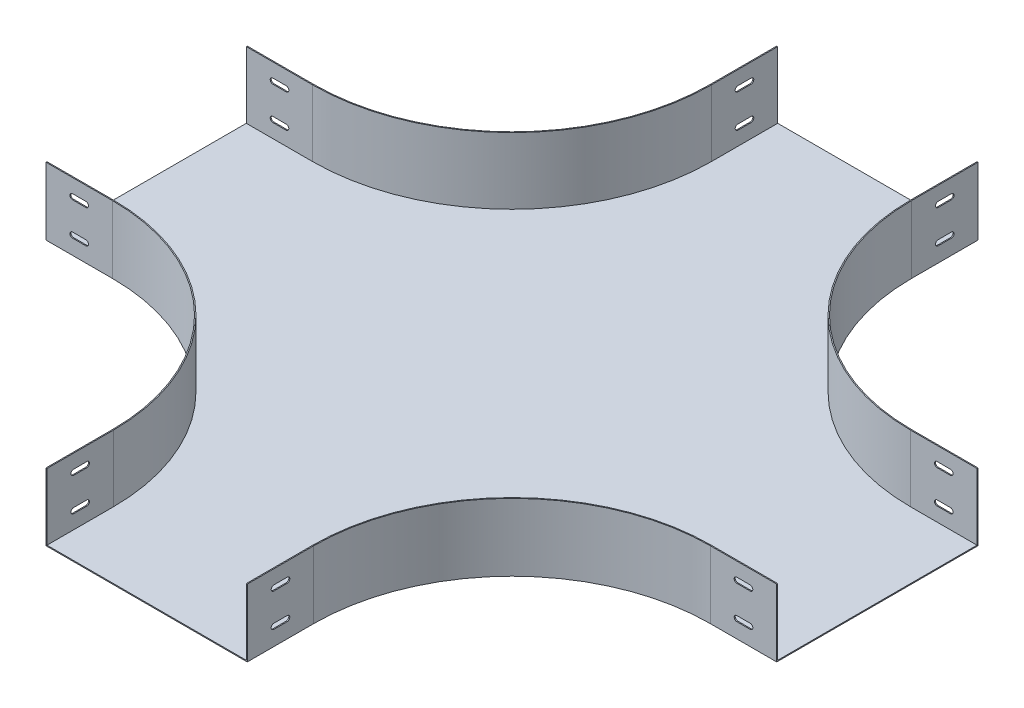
from build123d import *

# Parameters (mm, degrees)
BOSS_EXTRUDE1_DEPTH      = 1.5
EXTRUDE_THIN1_DEPTH      = 100
EXTRUDE_THIN1_DEPTH_BACK = 1.5
CUT_EXTRUDE1_DEPTH       = 785.219357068
CUT_EXTRUDE1_DEPTH_BACK  = 785.219357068
CUT_EXTRUDE2_DEPTH       = 785.219357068
CUT_EXTRUDE2_DEPTH_BACK  = 785.219357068


with BuildPart() as part:
    # Sketch1 → Boss-Extrude1 (new body)
    with BuildSketch(Plane(origin=(0, 0, 0), x_dir=(1, 0, 0), z_dir=(0, 1, 0))):
        with BuildLine():
            Line((-150, 550), (150, 550))
            Line((150, 550), (150, 450))
            ThreePointArc((150, 450), (237.867965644, 237.867965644), (450, 150))
            Line((450, 150), (550, 150))
            Line((550, 150), (550, -150))
            Line((550, -150), (450, -150))
            ThreePointArc((450, -150), (237.867965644, -237.867965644), (150, -450))
            Line((150, -450), (150, -550))
            Line((150, -550), (-150, -550))
            Line((-150, -550), (-150, -450))
            ThreePointArc((-150, -450), (-237.867965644, -237.867965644), (-450, -150))
            Line((-450, -150), (-550, -150))
            Line((-550, -150), (-550, 150))
            Line((-550, 150), (-450, 150))
            ThreePointArc((-450, 150), (-237.867965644, 237.867965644), (-150, 450))
            Line((-150, 450), (-150, 550))
        make_face()
    extrude(amount=-BOSS_EXTRUDE1_DEPTH)

    # Sketch2 → Extrude-Thin1 (add, two sides: drawn at the far end of the back side and taken through both)
    with BuildSketch(Plane(origin=(0, 0, 0), x_dir=(1, 0, 0), z_dir=(0, 1, 0)).offset(-EXTRUDE_THIN1_DEPTH_BACK)):
        with BuildLine():
            Line((150, -550), (150, -450))
            ThreePointArc((150, -450), (237.867965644, -237.867965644), (450, -150))
            Line((450, -150), (550, -150))
            Line((550, -150), (550, -151.5))
            Line((550, -151.5), (450, -151.5))
            ThreePointArc((450, -151.5), (238.928625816, -238.928625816), (151.5, -450))
            Line((151.5, -450), (151.5, -550))
            Line((151.5, -550), (150, -550))
        make_face()
        with BuildLine():
            Line((550, 150), (450, 150))
            ThreePointArc((450, 150), (237.867965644, 237.867965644), (150, 450))
            Line((150, 450), (150, 550))
            Line((150, 550), (151.5, 550))
            Line((151.5, 550), (151.5, 450))
            ThreePointArc((151.5, 450), (238.928625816, 238.928625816), (450, 151.5))
            Line((450, 151.5), (550, 151.5))
            Line((550, 151.5), (550, 150))
        make_face()
        with BuildLine():
            Line((-150, 550), (-150, 450))
            ThreePointArc((-150, 450), (-237.867965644, 237.867965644), (-450, 150))
            Line((-450, 150), (-550, 150))
            Line((-550, 150), (-550, 151.5))
            Line((-550, 151.5), (-450, 151.5))
            ThreePointArc((-450, 151.5), (-238.928625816, 238.928625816), (-151.5, 450))
            Line((-151.5, 450), (-151.5, 550))
            Line((-151.5, 550), (-150, 550))
        make_face()
        with BuildLine():
            Line((-550, -150), (-450, -150))
            ThreePointArc((-450, -150), (-237.867965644, -237.867965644), (-150, -450))
            Line((-150, -450), (-150, -550))
            Line((-150, -550), (-151.5, -550))
            Line((-151.5, -550), (-151.5, -450))
            ThreePointArc((-151.5, -450), (-238.928625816, -238.928625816), (-450, -151.5))
            Line((-450, -151.5), (-550, -151.5))
            Line((-550, -151.5), (-550, -150))
        make_face()
    extrude(amount=EXTRUDE_THIN1_DEPTH + EXTRUDE_THIN1_DEPTH_BACK)

    # Sketch3 → Cut-Extrude1 (cut, two sides: drawn at the far end of the back side and taken through both)
    with BuildSketch(Plane.XY.offset(-CUT_EXTRUDE1_DEPTH_BACK)):
        with BuildLine():
            Line((490, 79), (510, 79))
            ThreePointArc((510, 79), (514, 75), (510, 71))
            Line((510, 71), (490, 71))
            ThreePointArc((490, 71), (486, 75), (490, 79))
        make_face()
        with BuildLine():
            Line((490, 29), (510, 29))
            ThreePointArc((510, 29), (514, 25), (510, 21))
            Line((510, 21), (490, 21))
            ThreePointArc((490, 21), (486, 25), (490, 29))
        make_face()
        with BuildLine():
            Line((-510, 79), (-490, 79))
            ThreePointArc((-490, 79), (-486, 75), (-490, 71))
            Line((-490, 71), (-510, 71))
            ThreePointArc((-510, 71), (-514, 75), (-510, 79))
        make_face()
        with BuildLine():
            Line((-510, 29), (-490, 29))
            ThreePointArc((-490, 29), (-486, 25), (-490, 21))
            Line((-490, 21), (-510, 21))
            ThreePointArc((-510, 21), (-514, 25), (-510, 29))
        make_face()
    extrude(amount=CUT_EXTRUDE1_DEPTH + CUT_EXTRUDE1_DEPTH_BACK, mode=Mode.SUBTRACT)

    # Sketch4 → Cut-Extrude2 (cut, two sides: drawn at the far end of the back side and taken through both)
    with BuildSketch(Plane(origin=(0, 0, 0), x_dir=(0, 0, -1), z_dir=(1, 0, 0)).offset(-CUT_EXTRUDE2_DEPTH_BACK)):
        with BuildLine():
            Line((-510, 79), (-490, 79))
            ThreePointArc((-490, 79), (-486, 75), (-490, 71))
            Line((-490, 71), (-510, 71))
            ThreePointArc((-510, 71), (-514, 75), (-510, 79))
        make_face()
        with BuildLine():
            Line((-510, 29), (-490, 29))
            ThreePointArc((-490, 29), (-486, 25), (-490, 21))
            Line((-490, 21), (-510, 21))
            ThreePointArc((-510, 21), (-514, 25), (-510, 29))
        make_face()
        with BuildLine():
            Line((490, 79), (510, 79))
            ThreePointArc((510, 79), (514, 75), (510, 71))
            Line((510, 71), (490, 71))
            ThreePointArc((490, 71), (486, 75), (490, 79))
        make_face()
        with BuildLine():
            Line((490, 29), (510, 29))
            ThreePointArc((510, 29), (514, 25), (510, 21))
            Line((510, 21), (490, 21))
            ThreePointArc((490, 21), (486, 25), (490, 29))
        make_face()
    extrude(amount=CUT_EXTRUDE2_DEPTH + CUT_EXTRUDE2_DEPTH_BACK, mode=Mode.SUBTRACT)


solid = part.part
